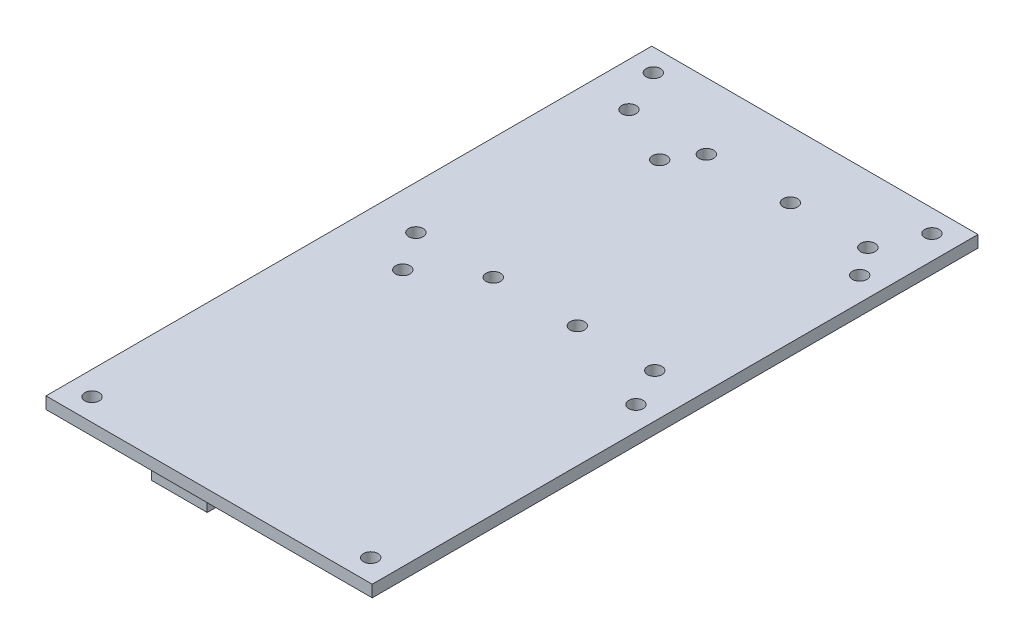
from build123d import *

# Parameters (mm, degrees)
SKETCH1_W                = 70.0024
SKETCH1_H                = 129.9972
BOSS_EXTRUDE1_DEPTH      = 2.54
SKETCH2_R                = 1.5499969
MOUNTING_DEPTH           = 148.668749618
SKETCH3_R                = 1.5499969
STRATOLOGGER_MOUNT_DEPTH = 148.668749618
SKETCH4_R                = 1.5499969
RADIO_MOUNT_DEPTH        = 148.668749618
SKETCH5_W                = 12.0000014
SKETCH5_H                = 14.050000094
BOSS_EXTRUDE2_DEPTH      = 5.999988


with BuildPart() as part:
    # Sketch1 → Boss-Extrude1 (new body)
    with BuildSketch(Plane(origin=(0, 0, 0), x_dir=(1, 0, 0), z_dir=(0, 1, 0))):
        with Locations((35.0012, 64.9986)):
            Rectangle(SKETCH1_W, SKETCH1_H)
    extrude(amount=BOSS_EXTRUDE1_DEPTH)

    # Sketch2 → Mounting (cut, through all)
    with BuildSketch(Plane(origin=(0, 2.54, 0), x_dir=(1, 0, 0), z_dir=(0, 1, 0))):
        with Locations(Location((5.1054, 125.222, 0), (0, 0, 270))):
            Circle(SKETCH2_R)
        with Locations(Location((64.897, 125.222, 0), (0, 0, 270))):
            Circle(SKETCH2_R)
        with Locations(Location((64.897, 4.7752, 0), (0, 0, 270))):
            Circle(SKETCH2_R)
        with Locations(Location((5.1054, 4.7752, 0), (0, 0, 270))):
            Circle(SKETCH2_R)
    extrude(amount=-MOUNTING_DEPTH, mode=Mode.SUBTRACT)

    # Sketch3 → Stratologger Mount (cut, through all)
    with BuildSketch(Plane(origin=(0, 2.54, 0), x_dir=(1, 0, 0), z_dir=(0, 1, 0))):
        with Locations(Location((9.3480001, 115.748199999, 0), (0, 0, 270))):
            Circle(SKETCH3_R)
        with Locations(Location((9.3480001, 70.028199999, 0), (0, 0, 270))):
            Circle(SKETCH3_R)
        with Locations(Location((25.9596001, 70.028199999, 0), (0, 0, 270))):
            Circle(SKETCH3_R)
        with Locations(Location((25.9596001, 115.748199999, 0), (0, 0, 270))):
            Circle(SKETCH3_R)
        with Locations(Location((43.9928, 115.748199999, 0), (0, 0, 270))):
            Circle(SKETCH3_R)
        with Locations(Location((60.6044, 115.748199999, 0), (0, 0, 270))):
            Circle(SKETCH3_R)
        with Locations(Location((60.6044, 70.028199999, 0), (0, 0, 270))):
            Circle(SKETCH3_R)
        with Locations(Location((43.9928, 70.028199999, 0), (0, 0, 270))):
            Circle(SKETCH3_R)
    extrude(amount=-STRATOLOGGER_MOUNT_DEPTH, mode=Mode.SUBTRACT)

    # Sketch4 → Radio Mount (cut, through all)
    with BuildSketch(Plane(origin=(0, 2.54, 0), x_dir=(1, 0, 0), z_dir=(0, 1, 0))):
        with Locations(Location((21.971, 109.712200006, 0), (0, 0, 270))):
            Circle(SKETCH4_R)
        with Locations(Location((64.897, 109.712200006, 0), (0, 0, 270))):
            Circle(SKETCH4_R)
        with Locations(Location((64.897, 61.706200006, 0), (0, 0, 270))):
            Circle(SKETCH4_R)
        with Locations(Location((14.859, 61.706200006, 0), (0, 0, 270))):
            Circle(SKETCH4_R)
    extrude(amount=-RADIO_MOUNT_DEPTH, mode=Mode.SUBTRACT)

    # Sketch5 → Boss-Extrude2 (add)
    with BuildSketch(Plane(origin=(0, 0, 0), x_dir=(-1, 0, 0), z_dir=(0, -1, 0))):
        with Locations((-24.438000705, 11.184999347)):
            Rectangle(SKETCH5_W, SKETCH5_H)
        with Locations((-34.9560007, 120.944200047)):
            Rectangle(SKETCH5_W, SKETCH5_H)
    extrude(amount=BOSS_EXTRUDE2_DEPTH)


solid = part.part
